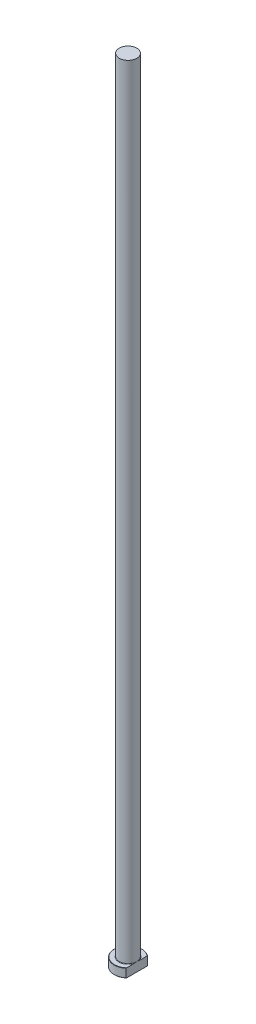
ISO-10303-21;
HEADER;
FILE_DESCRIPTION(('STEP AP214'),'2;1');
FILE_NAME('part.step','',(''),(''),'','','');
FILE_SCHEMA(('AUTOMOTIVE_DESIGN { 1 0 10303 214 1 1 1 1 }'));
ENDSEC;
DATA;
#1=APPLICATION_CONTEXT('core data for automotive mechanical design processes');
#2=APPLICATION_PROTOCOL_DEFINITION('international standard','automotive_design',2000,#1);
#3=PRODUCT_CONTEXT('',#1,'mechanical');
#4=PRODUCT('Part','Part','',(#3));
#5=PRODUCT_RELATED_PRODUCT_CATEGORY('part','',(#4));
#6=PRODUCT_DEFINITION_FORMATION('','',#4);
#7=PRODUCT_DEFINITION_CONTEXT('part definition',#1,'design');
#8=PRODUCT_DEFINITION('design','',#6,#7);
#9=PRODUCT_DEFINITION_SHAPE('','',#8);
#10=(LENGTH_UNIT() NAMED_UNIT(*) SI_UNIT(.MILLI.,.METRE.));
#11=(NAMED_UNIT(*) PLANE_ANGLE_UNIT() SI_UNIT($,.RADIAN.));
#12=(NAMED_UNIT(*) SI_UNIT($,.STERADIAN.) SOLID_ANGLE_UNIT());
#13=UNCERTAINTY_MEASURE_WITH_UNIT(LENGTH_MEASURE(1.E-05),#10,'distance_accuracy_value','');
#14=(GEOMETRIC_REPRESENTATION_CONTEXT(3) GLOBAL_UNCERTAINTY_ASSIGNED_CONTEXT((#13)) GLOBAL_UNIT_ASSIGNED_CONTEXT((#10,
#11,#12)) REPRESENTATION_CONTEXT('',''));
#15=CARTESIAN_POINT('',(0.,0.,0.));
#16=DIRECTION('',(0.,0.,1.));
#17=DIRECTION('',(1.,0.,0.));
#18=AXIS2_PLACEMENT_3D('',#15,#16,#17);
#19=CARTESIAN_POINT('',(0.,0.,0.));
#20=DIRECTION('',(0.,-1.,0.));
#21=DIRECTION('',(0.,0.,-1.));
#22=AXIS2_PLACEMENT_3D('',#19,#20,#21);
#23=PLANE('',#22);
#24=CARTESIAN_POINT('',(0.,0.,0.));
#25=DIRECTION('',(0.,-1.,0.));
#26=DIRECTION('',(0.,0.,-1.));
#27=AXIS2_PLACEMENT_3D('',#24,#25,#26);
#28=CIRCLE('',#27,10.8);
#29=CARTESIAN_POINT('',(6.99999999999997,0.,8.22435407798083));
#30=VERTEX_POINT('',#29);
#31=CARTESIAN_POINT('',(6.99999999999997,0.,-8.22435407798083));
#32=VERTEX_POINT('',#31);
#33=EDGE_CURVE('E98',#30,#32,#28,.T.);
#34=ORIENTED_EDGE('',*,*,#33,.T.);
#35=DIRECTION('',(0.,0.,1.));
#36=VECTOR('',#35,1.);
#37=CARTESIAN_POINT('',(6.99999999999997,0.,-8.48528137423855));
#38=LINE('',#37,#36);
#39=EDGE_CURVE('E83',#32,#30,#38,.T.);
#40=ORIENTED_EDGE('',*,*,#39,.T.);
#41=EDGE_LOOP('',(#34,#40));
#42=FACE_BOUND('',#41,.T.);
#43=ADVANCED_FACE('F32',(#42),#23,.T.);
#44=CARTESIAN_POINT('',(0.,259.958771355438,0.));
#45=DIRECTION('',(0.,1.,0.));
#46=DIRECTION('',(0.,0.,1.));
#47=AXIS2_PLACEMENT_3D('',#44,#45,#46);
#48=CYLINDRICAL_SURFACE('',#47,11.);
#49=CARTESIAN_POINT('',(0.,6.80000000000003,0.));
#50=DIRECTION('',(0.,1.,0.));
#51=DIRECTION('',(0.,0.,1.));
#52=AXIS2_PLACEMENT_3D('',#49,#50,#51);
#53=CIRCLE('',#52,11.);
#54=CARTESIAN_POINT('',(6.99999999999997,6.80000000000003,8.48528137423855));
#55=VERTEX_POINT('',#54);
#56=CARTESIAN_POINT('',(6.99999999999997,6.80000000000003,-8.48528137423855));
#57=VERTEX_POINT('',#56);
#58=EDGE_CURVE('E104',#55,#57,#53,.F.);
#59=ORIENTED_EDGE('',*,*,#58,.T.);
#60=DIRECTION('',(0.,-1.,0.));
#61=VECTOR('',#60,1.);
#62=CARTESIAN_POINT('',(6.99999999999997,630.,-8.48528137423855));
#63=LINE('',#62,#61);
#64=CARTESIAN_POINT('',(6.99999999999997,0.200000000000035,-8.48528137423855));
#65=VERTEX_POINT('',#64);
#66=EDGE_CURVE('E183',#57,#65,#63,.T.);
#67=ORIENTED_EDGE('',*,*,#66,.T.);
#68=CARTESIAN_POINT('',(0.,0.200000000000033,0.));
#69=DIRECTION('',(0.,-1.,0.));
#70=DIRECTION('',(0.,0.,-1.));
#71=AXIS2_PLACEMENT_3D('',#68,#69,#70);
#72=CIRCLE('',#71,11.);
#73=CARTESIAN_POINT('',(6.99999999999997,0.200000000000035,8.48528137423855));
#74=VERTEX_POINT('',#73);
#75=EDGE_CURVE('E100',#65,#74,#72,.F.);
#76=ORIENTED_EDGE('',*,*,#75,.T.);
#77=DIRECTION('',(0.,-1.,0.));
#78=VECTOR('',#77,1.);
#79=CARTESIAN_POINT('',(6.99999999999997,630.,8.48528137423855));
#80=LINE('',#79,#78);
#81=EDGE_CURVE('E93',#55,#74,#80,.T.);
#82=ORIENTED_EDGE('',*,*,#81,.F.);
#83=EDGE_LOOP('',(#59,#67,#76,#82));
#84=FACE_BOUND('',#83,.T.);
#85=ADVANCED_FACE('F158',(#84),#48,.T.);
#86=CARTESIAN_POINT('',(-11.,7.,0.));
#87=DIRECTION('',(0.,1.,0.));
#88=DIRECTION('',(0.,0.,1.));
#89=AXIS2_PLACEMENT_3D('',#86,#87,#88);
#90=PLANE('',#89);
#91=CARTESIAN_POINT('',(0.,7.,0.));
#92=DIRECTION('',(0.,1.,0.));
#93=DIRECTION('',(0.,0.,1.));
#94=AXIS2_PLACEMENT_3D('',#91,#92,#93);
#95=CIRCLE('',#94,10.8);
#96=CARTESIAN_POINT('',(6.99999999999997,7.,-8.22435407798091));
#97=VERTEX_POINT('',#96);
#98=CARTESIAN_POINT('',(6.99999999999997,7.,8.22435407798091));
#99=VERTEX_POINT('',#98);
#100=EDGE_CURVE('E178',#97,#99,#95,.T.);
#101=ORIENTED_EDGE('',*,*,#100,.T.);
#102=DIRECTION('',(0.,0.,-1.));
#103=VECTOR('',#102,1.);
#104=CARTESIAN_POINT('',(6.99999999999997,7.,0.));
#105=LINE('',#104,#103);
#106=CARTESIAN_POINT('',(6.99999999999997,6.99999999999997,2.07123151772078));
#107=VERTEX_POINT('',#106);
#108=EDGE_CURVE('E57',#99,#107,#105,.T.);
#109=ORIENTED_EDGE('',*,*,#108,.T.);
#110=CARTESIAN_POINT('',(0.,7.,0.));
#111=DIRECTION('',(0.,1.,0.));
#112=DIRECTION('',(0.,0.,1.));
#113=AXIS2_PLACEMENT_3D('',#110,#111,#112);
#114=CIRCLE('',#113,7.29999999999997);
#115=CARTESIAN_POINT('',(6.99999999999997,6.99999999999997,-2.07123151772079));
#116=VERTEX_POINT('',#115);
#117=EDGE_CURVE('E107',#107,#116,#114,.F.);
#118=ORIENTED_EDGE('',*,*,#117,.T.);
#119=EDGE_CURVE('E136',#116,#97,#105,.T.);
#120=ORIENTED_EDGE('',*,*,#119,.T.);
#121=EDGE_LOOP('',(#101,#109,#118,#120));
#122=FACE_BOUND('',#121,.T.);
#123=ADVANCED_FACE('F147',(#122),#90,.T.);
#124=CARTESIAN_POINT('',(0.,7.00000000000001,0.));
#125=DIRECTION('',(0.,-1.,0.));
#126=DIRECTION('',(0.,0.,-1.));
#127=AXIS2_PLACEMENT_3D('',#124,#125,#126);
#128=CONICAL_SURFACE('',#127,10.8,0.785398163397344);
#129=ORIENTED_EDGE('',*,*,#58,.F.);
#130=CARTESIAN_POINT('',(6.99999999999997,-2.1377497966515,18.6685261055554));
#131=CARTESIAN_POINT('',(6.99999999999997,-1.86574872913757,18.3780244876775));
#132=CARTESIAN_POINT('',(6.99999999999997,-1.59415659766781,18.0871392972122));
#133=CARTESIAN_POINT('',(6.99999999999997,-1.05192877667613,17.5044755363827));
#134=CARTESIAN_POINT('',(6.99999999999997,-0.781293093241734,17.2126969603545));
#135=CARTESIAN_POINT('',(6.99999999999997,-0.241050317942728,16.6280482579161));
#136=CARTESIAN_POINT('',(6.99999999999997,0.0285564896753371,16.3351778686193));
#137=CARTESIAN_POINT('',(6.99999999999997,0.566485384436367,15.7482616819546));
#138=CARTESIAN_POINT('',(6.99999999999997,0.834807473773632,15.454215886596));
#139=CARTESIAN_POINT('',(6.99999999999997,1.64198377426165,14.5651645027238));
#140=CARTESIAN_POINT('',(6.99999999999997,2.17856420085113,13.9680841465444));
#141=CARTESIAN_POINT('',(6.99999999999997,2.97696333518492,13.0668144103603));
#142=CARTESIAN_POINT('',(6.99999999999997,3.2419978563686,12.7654727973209));
#143=CARTESIAN_POINT('',(6.99999999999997,3.76945856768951,12.1605141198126));
#144=CARTESIAN_POINT('',(6.99999999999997,4.03188476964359,11.8568970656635));
#145=CARTESIAN_POINT('',(6.99999999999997,4.50733797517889,11.3009625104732));
#146=CARTESIAN_POINT('',(6.99999999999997,4.72088020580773,11.0490858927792));
#147=CARTESIAN_POINT('',(6.99999999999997,5.14538078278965,10.5431655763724));
#148=CARTESIAN_POINT('',(6.99999999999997,5.35633915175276,10.2891218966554));
#149=CARTESIAN_POINT('',(6.99999999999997,5.77522964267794,9.77836737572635));
#150=CARTESIAN_POINT('',(6.99999999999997,5.98316044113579,9.52165544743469));
#151=CARTESIAN_POINT('',(6.99999999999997,6.39521098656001,9.0051908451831));
#152=CARTESIAN_POINT('',(6.99999999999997,6.5993307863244,8.74543821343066));
#153=CARTESIAN_POINT('',(6.99999999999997,7.0024344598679,8.22283607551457));
#154=CARTESIAN_POINT('',(6.99999999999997,7.20142819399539,7.95999419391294));
#155=CARTESIAN_POINT('',(6.99999999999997,7.59353840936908,7.42991856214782));
#156=CARTESIAN_POINT('',(6.99999999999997,7.7866544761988,7.16268450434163));
#157=CARTESIAN_POINT('',(6.99999999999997,8.16523718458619,6.62311113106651));
#158=CARTESIAN_POINT('',(6.99999999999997,8.35070911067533,6.35077553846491));
#159=CARTESIAN_POINT('',(6.99999999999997,8.71189725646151,5.79973731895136));
#160=CARTESIAN_POINT('',(6.99999999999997,8.8876153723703,5.52103594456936));
#161=CARTESIAN_POINT('',(6.99999999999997,9.19554959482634,5.00707921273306));
#162=CARTESIAN_POINT('',(6.99999999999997,9.32988075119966,4.77309669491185));
#163=CARTESIAN_POINT('',(6.99999999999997,9.58764253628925,4.29911523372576));
#164=CARTESIAN_POINT('',(6.99999999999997,9.71107181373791,4.05911554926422));
#165=CARTESIAN_POINT('',(6.99999999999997,9.94390907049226,3.57263619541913));
#166=CARTESIAN_POINT('',(6.99999999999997,10.0533307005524,3.32616312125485));
#167=CARTESIAN_POINT('',(6.99999999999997,10.2545146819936,2.82607166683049));
#168=CARTESIAN_POINT('',(6.99999999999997,10.3462820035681,2.57245532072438));
#169=CARTESIAN_POINT('',(6.99999999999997,10.4907049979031,2.1125444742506));
#170=CARTESIAN_POINT('',(6.99999999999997,10.5475277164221,1.90756611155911));
#171=CARTESIAN_POINT('',(6.99999999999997,10.6452043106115,1.4938116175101));
#172=CARTESIAN_POINT('',(6.99999999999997,10.68606033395,1.2850360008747));
#173=CARTESIAN_POINT('',(6.99999999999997,10.7497550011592,0.865342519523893));
#174=CARTESIAN_POINT('',(6.99999999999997,10.7726462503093,0.654432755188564));
#175=CARTESIAN_POINT('',(6.99999999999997,10.7993569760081,0.23139650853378));
#176=CARTESIAN_POINT('',(6.99999999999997,10.8031771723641,0.0192700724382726));
#177=CARTESIAN_POINT('',(6.99999999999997,10.791517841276,-0.404715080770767));
#178=CARTESIAN_POINT('',(6.99999999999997,10.7760135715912,-0.616573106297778));
#179=CARTESIAN_POINT('',(6.99999999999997,10.7265413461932,-1.03810446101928));
#180=CARTESIAN_POINT('',(6.99999999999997,10.6925718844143,-1.24777761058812));
#181=CARTESIAN_POINT('',(6.99999999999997,10.6077703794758,-1.66430273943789));
#182=CARTESIAN_POINT('',(6.99999999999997,10.5568873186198,-1.87114418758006));
#183=CARTESIAN_POINT('',(6.99999999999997,10.4404729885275,-2.2806127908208));
#184=CARTESIAN_POINT('',(6.99999999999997,10.3749414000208,-2.48323985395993));
#185=CARTESIAN_POINT('',(6.99999999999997,10.2190980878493,-2.91860265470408));
#186=CARTESIAN_POINT('',(6.99999999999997,10.1264616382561,-3.1505003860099));
#187=CARTESIAN_POINT('',(6.99999999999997,9.92740958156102,-3.6083545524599));
#188=CARTESIAN_POINT('',(6.99999999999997,9.82098769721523,-3.83430822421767));
#189=CARTESIAN_POINT('',(6.99999999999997,9.59695142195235,-4.28105341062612));
#190=CARTESIAN_POINT('',(6.99999999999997,9.47931762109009,-4.50183511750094));
#191=CARTESIAN_POINT('',(6.99999999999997,9.23524231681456,-4.93840249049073));
#192=CARTESIAN_POINT('',(6.99999999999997,9.1088020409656,-5.15418884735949));
#193=CARTESIAN_POINT('',(6.99999999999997,8.84714657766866,-5.58417945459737));
#194=CARTESIAN_POINT('',(6.99999999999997,8.7118392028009,-5.79832734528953));
#195=CARTESIAN_POINT('',(6.99999999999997,8.43533082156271,-6.22277635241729));
#196=CARTESIAN_POINT('',(6.99999999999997,8.29412966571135,-6.43307737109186));
#197=CARTESIAN_POINT('',(6.99999999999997,8.00706556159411,-6.85014007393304));
#198=CARTESIAN_POINT('',(6.99999999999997,7.86120763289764,-7.0569052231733));
#199=CARTESIAN_POINT('',(6.99999999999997,7.56553131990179,-7.4675727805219));
#200=CARTESIAN_POINT('',(6.99999999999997,7.41571298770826,-7.67147522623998));
#201=CARTESIAN_POINT('',(6.99999999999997,7.07999705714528,-8.12067189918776));
#202=CARTESIAN_POINT('',(6.99999999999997,6.89330819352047,-8.36537403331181));
#203=CARTESIAN_POINT('',(6.99999999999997,6.51597189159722,-8.85171196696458));
#204=CARTESIAN_POINT('',(6.99999999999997,6.32532432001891,-9.09334766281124));
#205=CARTESIAN_POINT('',(6.99999999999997,5.94076020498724,-9.57404667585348));
#206=CARTESIAN_POINT('',(6.99999999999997,5.74684327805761,-9.81310968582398));
#207=CARTESIAN_POINT('',(6.99999999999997,5.35630729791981,-10.2890203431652));
#208=CARTESIAN_POINT('',(6.99999999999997,5.1596882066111,-10.5258679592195));
#209=CARTESIAN_POINT('',(6.99999999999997,4.56606953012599,-11.2340330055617));
#210=CARTESIAN_POINT('',(6.99999999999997,4.1656814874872,-11.7025100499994));
#211=CARTESIAN_POINT('',(6.99999999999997,3.35840033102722,-12.6338245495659));
#212=CARTESIAN_POINT('',(6.99999999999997,2.9515070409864,-13.0966618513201));
#213=CARTESIAN_POINT('',(6.99999999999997,2.35017562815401,-13.7734103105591));
#214=CARTESIAN_POINT('',(6.99999999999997,2.1576381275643,-13.9890143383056));
#215=CARTESIAN_POINT('',(6.99999999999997,1.77161609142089,-14.4193671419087));
#216=CARTESIAN_POINT('',(6.99999999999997,1.57813157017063,-14.6341159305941));
#217=CARTESIAN_POINT('',(6.99999999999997,0.996412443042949,-15.2772388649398));
#218=CARTESIAN_POINT('',(6.99999999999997,0.606922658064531,-15.7044779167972));
#219=CARTESIAN_POINT('',(6.99999999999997,-0.173895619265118,-16.555652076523));
#220=CARTESIAN_POINT('',(6.99999999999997,-0.565218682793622,-16.9795921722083));
#221=CARTESIAN_POINT('',(6.99999999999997,-1.3499993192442,-17.8254589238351));
#222=CARTESIAN_POINT('',(6.99999999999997,-1.74345679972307,-18.2473856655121));
#223=CARTESIAN_POINT('',(6.99999999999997,-2.1377497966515,-18.6685261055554));
#224=B_SPLINE_CURVE_WITH_KNOTS('',3,(#130,#131,#132,#133,#134,#135,#136,#137,#138,#139,#140,
#141,#142,#143,#144,#145,#146,#147,#148,#149,#150,#151,#152,#153,#154,#155,#156,#157,#158,#159,
#160,#161,#162,#163,#164,#165,#166,#167,#168,#169,#170,#171,#172,#173,#174,#175,#176,#177,#178,
#179,#180,#181,#182,#183,#184,#185,#186,#187,#188,#189,#190,#191,#192,#193,#194,#195,#196,#197,
#198,#199,#200,#201,#202,#203,#204,#205,#206,#207,#208,#209,#210,#211,#212,#213,#214,#215,#216,
#217,#218,#219,#220,#221,#222,#223),.UNSPECIFIED.,.F.,.F.,(4,2,2,2,2,2,2,2,2,2,2,2,2,2,2,2,2,2,
2,2,2,2,2,2,2,2,2,2,2,2,2,2,2,2,2,2,2,2,2,2,2,2,2,2,2,2,4),(0.,1.19389386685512,
2.38779531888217,3.58200567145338,4.77621398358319,7.1844215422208,8.38834194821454,
9.59225689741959,10.5828886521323,11.5735117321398,12.5645555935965,13.5555857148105,
14.544540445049,15.5335647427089,16.5218934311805,17.5100293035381,18.319208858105,
19.1284885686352,19.9369735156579,20.7452305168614,21.382812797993,22.0203092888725,
22.6559319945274,23.2915307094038,23.927944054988,24.564409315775,25.2028120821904,
25.8412287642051,26.5898097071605,27.3387327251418,28.0889766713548,28.8391162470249,
29.5989369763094,30.3587769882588,31.1178239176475,31.87686086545,32.8001653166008,
33.7235009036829,34.6469455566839,35.5704032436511,37.4191008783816,39.2678486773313,
40.1350269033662,41.0021920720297,42.736569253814,44.4673795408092,46.1981154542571),.UNSPECIFIED.);
#225=EDGE_CURVE('E135',#55,#99,#224,.T.);
#226=ORIENTED_EDGE('',*,*,#225,.T.);
#227=ORIENTED_EDGE('',*,*,#100,.F.);
#228=EDGE_CURVE('E127',#97,#57,#224,.T.);
#229=ORIENTED_EDGE('',*,*,#228,.T.);
#230=EDGE_LOOP('',(#129,#226,#227,#229));
#231=FACE_BOUND('',#230,.T.);
#232=ADVANCED_FACE('F143',(#231),#128,.T.);
#233=CARTESIAN_POINT('',(0.,0.200000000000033,0.));
#234=DIRECTION('',(0.,1.,0.));
#235=DIRECTION('',(0.,0.,1.));
#236=AXIS2_PLACEMENT_3D('',#233,#234,#235);
#237=CONICAL_SURFACE('',#236,11.,0.785398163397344);
#238=ORIENTED_EDGE('',*,*,#75,.F.);
#239=CARTESIAN_POINT('',(6.99999999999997,9.13774979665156,-18.6685261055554));
#240=CARTESIAN_POINT('',(6.99999999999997,8.86574872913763,-18.3780244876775));
#241=CARTESIAN_POINT('',(6.99999999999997,8.59415659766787,-18.0871392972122));
#242=CARTESIAN_POINT('',(6.99999999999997,8.05192877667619,-17.5044755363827));
#243=CARTESIAN_POINT('',(6.99999999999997,7.7812930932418,-17.2126969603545));
#244=CARTESIAN_POINT('',(6.99999999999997,7.24105031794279,-16.6280482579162));
#245=CARTESIAN_POINT('',(6.99999999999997,6.97144351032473,-16.3351778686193));
#246=CARTESIAN_POINT('',(6.99999999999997,6.4335146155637,-15.7482616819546));
#247=CARTESIAN_POINT('',(6.99999999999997,6.16519252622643,-15.454215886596));
#248=CARTESIAN_POINT('',(6.99999999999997,5.35801622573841,-14.5651645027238));
#249=CARTESIAN_POINT('',(6.99999999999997,4.82143579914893,-13.9680841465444));
#250=CARTESIAN_POINT('',(6.99999999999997,4.02303666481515,-13.0668144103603));
#251=CARTESIAN_POINT('',(6.99999999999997,3.75800214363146,-12.7654727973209));
#252=CARTESIAN_POINT('',(6.99999999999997,3.23054143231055,-12.1605141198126));
#253=CARTESIAN_POINT('',(6.99999999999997,2.96811523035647,-11.8568970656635));
#254=CARTESIAN_POINT('',(6.99999999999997,2.49266202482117,-11.3009625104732));
#255=CARTESIAN_POINT('',(6.99999999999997,2.27911979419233,-11.0490858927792));
#256=CARTESIAN_POINT('',(6.99999999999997,1.85461921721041,-10.5431655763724));
#257=CARTESIAN_POINT('',(6.99999999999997,1.6436608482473,-10.2891218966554));
#258=CARTESIAN_POINT('',(6.99999999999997,1.22477035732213,-9.77836737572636));
#259=CARTESIAN_POINT('',(6.99999999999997,1.01683955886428,-9.5216554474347));
#260=CARTESIAN_POINT('',(6.99999999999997,0.60478901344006,-9.0051908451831));
#261=CARTESIAN_POINT('',(6.99999999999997,0.400669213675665,-8.74543821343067));
#262=CARTESIAN_POINT('',(6.99999999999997,-0.00243445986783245,-8.22283607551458));
#263=CARTESIAN_POINT('',(6.99999999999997,-0.201428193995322,-7.95999419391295));
#264=CARTESIAN_POINT('',(6.99999999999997,-0.59353840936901,-7.42991856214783));
#265=CARTESIAN_POINT('',(6.99999999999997,-0.786654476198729,-7.16268450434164));
#266=CARTESIAN_POINT('',(6.99999999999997,-1.16523718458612,-6.62311113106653));
#267=CARTESIAN_POINT('',(6.99999999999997,-1.35070911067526,-6.35077553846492));
#268=CARTESIAN_POINT('',(6.99999999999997,-1.71189725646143,-5.79973731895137));
#269=CARTESIAN_POINT('',(6.99999999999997,-1.88761537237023,-5.52103594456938));
#270=CARTESIAN_POINT('',(6.99999999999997,-2.19554959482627,-5.00707921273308));
#271=CARTESIAN_POINT('',(6.99999999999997,-2.32988075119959,-4.77309669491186));
#272=CARTESIAN_POINT('',(6.99999999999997,-2.58764253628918,-4.29911523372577));
#273=CARTESIAN_POINT('',(6.99999999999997,-2.71107181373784,-4.05911554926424));
#274=CARTESIAN_POINT('',(6.99999999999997,-2.94390907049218,-3.57263619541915));
#275=CARTESIAN_POINT('',(6.99999999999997,-3.05333070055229,-3.32616312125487));
#276=CARTESIAN_POINT('',(6.99999999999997,-3.25451468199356,-2.82607166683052));
#277=CARTESIAN_POINT('',(6.99999999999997,-3.34628200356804,-2.5724553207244));
#278=CARTESIAN_POINT('',(6.99999999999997,-3.49070499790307,-2.11254447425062));
#279=CARTESIAN_POINT('',(6.99999999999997,-3.54752771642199,-1.90756611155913));
#280=CARTESIAN_POINT('',(6.99999999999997,-3.6452043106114,-1.49381161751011));
#281=CARTESIAN_POINT('',(6.99999999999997,-3.68606033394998,-1.28503600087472));
#282=CARTESIAN_POINT('',(6.99999999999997,-3.74975500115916,-0.865342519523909));
#283=CARTESIAN_POINT('',(6.99999999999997,-3.77264625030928,-0.65443275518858));
#284=CARTESIAN_POINT('',(6.99999999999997,-3.79935697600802,-0.231396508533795));
#285=CARTESIAN_POINT('',(6.99999999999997,-3.80317717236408,-0.0192700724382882));
#286=CARTESIAN_POINT('',(6.99999999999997,-3.79151784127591,0.40471508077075));
#287=CARTESIAN_POINT('',(6.99999999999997,-3.77601357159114,0.61657310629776));
#288=CARTESIAN_POINT('',(6.99999999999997,-3.72654134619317,1.03810446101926));
#289=CARTESIAN_POINT('',(6.99999999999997,-3.69257188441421,1.2477776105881));
#290=CARTESIAN_POINT('',(6.99999999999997,-3.6077703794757,1.66430273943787));
#291=CARTESIAN_POINT('',(6.99999999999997,-3.55688731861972,1.87114418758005));
#292=CARTESIAN_POINT('',(6.99999999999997,-3.44047298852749,2.28061279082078));
#293=CARTESIAN_POINT('',(6.99999999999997,-3.37494140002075,2.48323985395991));
#294=CARTESIAN_POINT('',(6.99999999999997,-3.21909808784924,2.91860265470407));
#295=CARTESIAN_POINT('',(6.99999999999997,-3.12646163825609,3.15050038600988));
#296=CARTESIAN_POINT('',(6.99999999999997,-2.92740958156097,3.60835455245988));
#297=CARTESIAN_POINT('',(6.99999999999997,-2.82098769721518,3.83430822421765));
#298=CARTESIAN_POINT('',(6.99999999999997,-2.5969514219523,4.2810534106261));
#299=CARTESIAN_POINT('',(6.99999999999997,-2.47931762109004,4.50183511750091));
#300=CARTESIAN_POINT('',(6.99999999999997,-2.23524231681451,4.93840249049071));
#301=CARTESIAN_POINT('',(6.99999999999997,-2.10880204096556,5.15418884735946));
#302=CARTESIAN_POINT('',(6.99999999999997,-1.84714657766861,5.58417945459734));
#303=CARTESIAN_POINT('',(6.99999999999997,-1.71183920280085,5.7983273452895));
#304=CARTESIAN_POINT('',(6.99999999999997,-1.43533082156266,6.22277635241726));
#305=CARTESIAN_POINT('',(6.99999999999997,-1.29412966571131,6.43307737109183));
#306=CARTESIAN_POINT('',(6.99999999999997,-1.00706556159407,6.85014007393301));
#307=CARTESIAN_POINT('',(6.99999999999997,-0.861207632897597,7.05690522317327));
#308=CARTESIAN_POINT('',(6.99999999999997,-0.565531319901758,7.46757278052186));
#309=CARTESIAN_POINT('',(6.99999999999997,-0.415712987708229,7.67147522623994));
#310=CARTESIAN_POINT('',(6.99999999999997,-0.0799970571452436,8.12067189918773));
#311=CARTESIAN_POINT('',(6.99999999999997,0.106691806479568,8.36537403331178));
#312=CARTESIAN_POINT('',(6.99999999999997,0.484028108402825,8.85171196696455));
#313=CARTESIAN_POINT('',(6.99999999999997,0.674675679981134,9.09334766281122));
#314=CARTESIAN_POINT('',(6.99999999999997,1.0592397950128,9.57404667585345));
#315=CARTESIAN_POINT('',(6.99999999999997,1.25315672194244,9.81310968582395));
#316=CARTESIAN_POINT('',(6.99999999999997,1.64369270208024,10.2890203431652));
#317=CARTESIAN_POINT('',(6.99999999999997,1.84031179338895,10.5258679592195));
#318=CARTESIAN_POINT('',(6.99999999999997,2.43393046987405,11.2340330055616));
#319=CARTESIAN_POINT('',(6.99999999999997,2.83431851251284,11.7025100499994));
#320=CARTESIAN_POINT('',(6.99999999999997,3.64159966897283,12.6338245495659));
#321=CARTESIAN_POINT('',(6.99999999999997,4.04849295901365,13.0966618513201));
#322=CARTESIAN_POINT('',(6.99999999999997,4.64982437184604,13.773410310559));
#323=CARTESIAN_POINT('',(6.99999999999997,4.84236187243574,13.9890143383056));
#324=CARTESIAN_POINT('',(6.99999999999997,5.22838390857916,14.4193671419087));
#325=CARTESIAN_POINT('',(6.99999999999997,5.42186842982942,14.6341159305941));
#326=CARTESIAN_POINT('',(6.99999999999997,6.0035875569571,15.2772388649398));
#327=CARTESIAN_POINT('',(6.99999999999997,6.39307734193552,15.7044779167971));
#328=CARTESIAN_POINT('',(6.99999999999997,7.17389561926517,16.555652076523));
#329=CARTESIAN_POINT('',(6.99999999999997,7.56521868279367,16.9795921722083));
#330=CARTESIAN_POINT('',(6.99999999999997,8.34999931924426,17.8254589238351));
#331=CARTESIAN_POINT('',(6.99999999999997,8.74345679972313,18.2473856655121));
#332=CARTESIAN_POINT('',(6.99999999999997,9.13774979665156,18.6685261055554));
#333=B_SPLINE_CURVE_WITH_KNOTS('',3,(#239,#240,#241,#242,#243,#244,#245,#246,#247,#248,#249,
#250,#251,#252,#253,#254,#255,#256,#257,#258,#259,#260,#261,#262,#263,#264,#265,#266,#267,#268,
#269,#270,#271,#272,#273,#274,#275,#276,#277,#278,#279,#280,#281,#282,#283,#284,#285,#286,#287,
#288,#289,#290,#291,#292,#293,#294,#295,#296,#297,#298,#299,#300,#301,#302,#303,#304,#305,#306,
#307,#308,#309,#310,#311,#312,#313,#314,#315,#316,#317,#318,#319,#320,#321,#322,#323,#324,#325,
#326,#327,#328,#329,#330,#331,#332),.UNSPECIFIED.,.F.,.F.,(4,2,2,2,2,2,2,2,2,2,2,2,2,2,2,2,2,2,
2,2,2,2,2,2,2,2,2,2,2,2,2,2,2,2,2,2,2,2,2,2,2,2,2,2,2,2,4),(0.,1.19389386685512,
2.38779531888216,3.58200567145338,4.77621398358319,7.18442154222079,8.38834194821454,
9.59225689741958,10.5828886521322,11.5735117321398,12.5645555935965,13.5555857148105,
14.544540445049,15.5335647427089,16.5218934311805,17.5100293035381,18.319208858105,
19.1284885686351,19.9369735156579,20.7452305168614,21.382812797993,22.0203092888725,
22.6559319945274,23.2915307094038,23.927944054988,24.564409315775,25.2028120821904,
25.8412287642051,26.5898097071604,27.3387327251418,28.0889766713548,28.8391162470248,
29.5989369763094,30.3587769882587,31.1178239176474,31.8768608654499,32.8001653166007,
33.7235009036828,34.6469455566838,35.5704032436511,37.4191008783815,39.2678486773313,
40.1350269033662,41.0021920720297,42.736569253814,44.4673795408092,46.1981154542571),.UNSPECIFIED.);
#334=EDGE_CURVE('E86',#65,#32,#333,.T.);
#335=ORIENTED_EDGE('',*,*,#334,.T.);
#336=ORIENTED_EDGE('',*,*,#33,.F.);
#337=EDGE_CURVE('E89',#30,#74,#333,.T.);
#338=ORIENTED_EDGE('',*,*,#337,.T.);
#339=EDGE_LOOP('',(#238,#335,#336,#338));
#340=FACE_BOUND('',#339,.T.);
#341=ADVANCED_FACE('F97',(#340),#237,.T.);
#342=CARTESIAN_POINT('',(0.,7.29999999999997,0.));
#343=DIRECTION('',(0.,1.,0.));
#344=DIRECTION('',(0.,0.,1.));
#345=AXIS2_PLACEMENT_3D('',#342,#343,#344);
#346=TOROIDAL_SURFACE('',#345,7.29999999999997,0.3);
#347=CARTESIAN_POINT('',(6.99999999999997,7.29999999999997,0.));
#348=CARTESIAN_POINT('',(6.99999999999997,7.30000062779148,2.32628005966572E-11));
#349=CARTESIAN_POINT('',(6.99999999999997,7.30000125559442,-3.16909134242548E-07));
#350=CARTESIAN_POINT('',(6.99999999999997,7.30000241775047,-1.14637029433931E-06));
#351=CARTESIAN_POINT('',(6.99999999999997,7.30000292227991,-1.68168827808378E-06));
#352=CARTESIAN_POINT('',(6.99999999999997,7.30000400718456,-2.97869768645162E-06));
#353=CARTESIAN_POINT('',(6.99999999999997,7.30000456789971,-3.76131367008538E-06));
#354=CARTESIAN_POINT('',(6.99999999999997,7.30000553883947,-5.35167977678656E-06));
#355=CARTESIAN_POINT('',(6.99999999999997,7.30000595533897,-6.15604635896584E-06));
#356=CARTESIAN_POINT('',(6.99999999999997,7.30000758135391,-9.388029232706E-06));
#357=CARTESIAN_POINT('',(6.99999999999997,7.30000871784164,-1.18573464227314E-05));
#358=CARTESIAN_POINT('',(6.99999999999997,7.30001050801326,-1.66549715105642E-05));
#359=CARTESIAN_POINT('',(6.99999999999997,7.30001120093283,-1.89691200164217E-05));
#360=CARTESIAN_POINT('',(6.99999999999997,7.30001423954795,-2.9073526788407E-05));
#361=CARTESIAN_POINT('',(6.99999999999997,7.30001661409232,-3.68567169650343E-05));
#362=CARTESIAN_POINT('',(6.99999999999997,7.30001997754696,-5.13387672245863E-05));
#363=CARTESIAN_POINT('',(6.99999999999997,7.30002113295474,-5.79981986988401E-05));
#364=CARTESIAN_POINT('',(6.99999999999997,7.30002974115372,-0.000108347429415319));
#365=CARTESIAN_POINT('',(6.99999999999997,7.30003649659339,-0.000152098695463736));
#366=CARTESIAN_POINT('',(6.99999999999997,7.30006604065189,-0.000326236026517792));
#367=CARTESIAN_POINT('',(6.99999999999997,7.30009398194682,-0.000455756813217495));
#368=CARTESIAN_POINT('',(6.99999999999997,7.30020370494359,-0.000971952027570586));
#369=CARTESIAN_POINT('',(6.99999999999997,7.30028233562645,-0.00135905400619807));
#370=CARTESIAN_POINT('',(6.99999999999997,7.30059908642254,-0.00290811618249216));
#371=CARTESIAN_POINT('',(6.99999999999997,7.30084128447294,-0.00406949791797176));
#372=CARTESIAN_POINT('',(6.99999999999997,7.30185637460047,-0.00894870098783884));
#373=CARTESIAN_POINT('',(6.99999999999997,7.30262406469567,-0.0126672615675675));
#374=CARTESIAN_POINT('',(6.99999999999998,7.30904362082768,-0.0437472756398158));
#375=CARTESIAN_POINT('',(6.99999999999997,7.31471492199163,-0.0711060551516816));
#376=CARTESIAN_POINT('',(6.99999999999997,7.3257989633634,-0.124711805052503));
#377=CARTESIAN_POINT('',(6.99999999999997,7.33121280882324,-0.150958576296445));
#378=CARTESIAN_POINT('',(6.99999999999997,7.34888721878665,-0.236855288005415));
#379=CARTESIAN_POINT('',(6.99999999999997,7.36109504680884,-0.296516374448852));
#380=CARTESIAN_POINT('',(6.99999999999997,7.38163193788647,-0.398125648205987));
#381=CARTESIAN_POINT('',(6.99999999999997,7.39003371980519,-0.440059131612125));
#382=CARTESIAN_POINT('',(6.99999999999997,7.40641913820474,-0.522820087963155));
#383=CARTESIAN_POINT('',(6.99999999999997,7.41440792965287,-0.563646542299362));
#384=CARTESIAN_POINT('',(6.99999999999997,7.44025584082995,-0.697745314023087));
#385=CARTESIAN_POINT('',(6.99999999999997,7.45763052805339,-0.791112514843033));
#386=CARTESIAN_POINT('',(6.99999999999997,7.4907040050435,-0.979068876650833));
#387=CARTESIAN_POINT('',(6.99999999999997,7.50638514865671,-1.07366117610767));
#388=CARTESIAN_POINT('',(6.99999999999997,7.53649600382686,-1.27237182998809));
#389=CARTESIAN_POINT('',(6.99999999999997,7.55066037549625,-1.37653153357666));
#390=CARTESIAN_POINT('',(6.99999999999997,7.57450660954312,-1.58508707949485));
#391=CARTESIAN_POINT('',(6.99999999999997,7.58420070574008,-1.68948148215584));
#392=CARTESIAN_POINT('',(6.99999999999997,7.5971656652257,-1.89515538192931));
#393=CARTESIAN_POINT('',(6.99999999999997,7.60064432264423,-1.9964196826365));
#394=CARTESIAN_POINT('',(6.99999999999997,7.59954163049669,-2.14745317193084));
#395=CARTESIAN_POINT('',(6.99999999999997,7.59815772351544,-2.19724153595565));
#396=CARTESIAN_POINT('',(6.99999999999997,7.59283451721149,-2.29666246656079));
#397=CARTESIAN_POINT('',(6.99999999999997,7.58889656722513,-2.34629510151));
#398=CARTESIAN_POINT('',(6.99999999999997,7.57769755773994,-2.44571674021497));
#399=CARTESIAN_POINT('',(6.99999999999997,7.57040396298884,-2.49550242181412));
#400=CARTESIAN_POINT('',(6.99999999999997,7.5560244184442,-2.56951537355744));
#401=CARTESIAN_POINT('',(6.99999999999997,7.55065780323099,-2.59407625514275));
#402=CARTESIAN_POINT('',(6.99999999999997,7.53852479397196,-2.642845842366));
#403=CARTESIAN_POINT('',(6.99999999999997,7.53175908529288,-2.66705471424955));
#404=CARTESIAN_POINT('',(6.99999999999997,7.5174892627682,-2.71174649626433));
#405=CARTESIAN_POINT('',(6.99999999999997,7.510201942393,-2.73229789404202));
#406=CARTESIAN_POINT('',(6.99999999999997,7.4939308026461,-2.77282387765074));
#407=CARTESIAN_POINT('',(6.99999999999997,7.4849410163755,-2.79279614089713));
#408=CARTESIAN_POINT('',(6.99999999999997,7.46462265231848,-2.83190553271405));
#409=CARTESIAN_POINT('',(6.99999999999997,7.45326134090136,-2.85102586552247));
#410=CARTESIAN_POINT('',(6.99999999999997,7.4274542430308,-2.88704231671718));
#411=CARTESIAN_POINT('',(6.99999999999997,7.41303489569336,-2.90395561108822));
#412=CARTESIAN_POINT('',(6.99999999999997,7.39049681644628,-2.92384155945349));
#413=CARTESIAN_POINT('',(6.99999999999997,7.3841904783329,-2.92884725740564));
#414=CARTESIAN_POINT('',(6.99999999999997,7.3709718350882,-2.9380049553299));
#415=CARTESIAN_POINT('',(6.99999999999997,7.36405938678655,-2.94215675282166));
#416=CARTESIAN_POINT('',(6.99999999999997,7.34956926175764,-2.94936604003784));
#417=CARTESIAN_POINT('',(6.99999999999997,7.34198467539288,-2.95240998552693));
#418=CARTESIAN_POINT('',(6.99999999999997,7.32637763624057,-2.95700924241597));
#419=CARTESIAN_POINT('',(6.99999999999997,7.31835605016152,-2.95856739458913));
#420=CARTESIAN_POINT('',(6.99999999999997,7.3029104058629,-2.95992508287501));
#421=CARTESIAN_POINT('',(6.99999999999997,7.29549953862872,-2.95987367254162));
#422=CARTESIAN_POINT('',(6.99999999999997,7.28081803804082,-2.95838504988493));
#423=CARTESIAN_POINT('',(6.99999999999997,7.27354749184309,-2.95694700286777));
#424=CARTESIAN_POINT('',(6.99999999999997,7.25853285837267,-2.95260391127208));
#425=CARTESIAN_POINT('',(6.99999999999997,7.25083383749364,-2.94954604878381));
#426=CARTESIAN_POINT('',(6.99999999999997,7.23603628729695,-2.9422241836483));
#427=CARTESIAN_POINT('',(6.99999999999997,7.22893877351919,-2.93795819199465));
#428=CARTESIAN_POINT('',(6.99999999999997,7.21163875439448,-2.92593351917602));
#429=CARTESIAN_POINT('',(6.99999999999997,7.20187862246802,-2.91754511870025));
#430=CARTESIAN_POINT('',(6.99999999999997,7.18370674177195,-2.89942475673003));
#431=CARTESIAN_POINT('',(6.99999999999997,7.17529892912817,-2.88968902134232));
#432=CARTESIAN_POINT('',(6.99999999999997,7.15199560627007,-2.85953893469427));
#433=CARTESIAN_POINT('',(6.99999999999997,7.13869481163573,-2.83790736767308));
#434=CARTESIAN_POINT('',(6.99999999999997,7.11507068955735,-2.79314645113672));
#435=CARTESIAN_POINT('',(6.99999999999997,7.10475206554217,-2.77001480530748));
#436=CARTESIAN_POINT('',(6.99999999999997,7.08155610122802,-2.7108784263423));
#437=CARTESIAN_POINT('',(6.99999999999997,7.07006528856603,-2.67433519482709));
#438=CARTESIAN_POINT('',(6.99999999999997,7.05044959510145,-2.60033159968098));
#439=CARTESIAN_POINT('',(6.99999999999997,7.04233234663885,-2.5628693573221));
#440=CARTESIAN_POINT('',(6.99999999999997,7.02853576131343,-2.48688638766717));
#441=CARTESIAN_POINT('',(6.99999999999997,7.02289758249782,-2.4483583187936));
#442=CARTESIAN_POINT('',(6.99999999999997,7.01369461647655,-2.37112071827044));
#443=CARTESIAN_POINT('',(6.99999999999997,7.01012698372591,-2.33241150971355));
#444=CARTESIAN_POINT('',(6.99999999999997,7.00239886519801,-2.22280038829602));
#445=CARTESIAN_POINT('',(6.99999999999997,7.00019016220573,-2.15176184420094));
#446=CARTESIAN_POINT('',(6.99999999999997,6.99983406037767,-2.0096618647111));
#447=CARTESIAN_POINT('',(6.99999999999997,7.00168936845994,-1.9386004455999));
#448=CARTESIAN_POINT('',(6.99999999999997,7.00854815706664,-1.79630907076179));
#449=CARTESIAN_POINT('',(6.99999999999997,7.01356610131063,-1.7250798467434));
#450=CARTESIAN_POINT('',(6.99999999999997,7.02608998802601,-1.5828366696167));
#451=CARTESIAN_POINT('',(6.99999999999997,7.03359634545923,-1.51182275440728));
#452=CARTESIAN_POINT('',(6.99999999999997,7.0575822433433,-1.31152735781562));
#453=CARTESIAN_POINT('',(6.99999999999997,7.07635481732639,-1.18252326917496));
#454=CARTESIAN_POINT('',(6.99999999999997,7.11790553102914,-0.926646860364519));
#455=CARTESIAN_POINT('',(6.99999999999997,7.14063741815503,-0.799766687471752));
#456=CARTESIAN_POINT('',(6.99999999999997,7.17322033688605,-0.627620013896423));
#457=CARTESIAN_POINT('',(6.99999999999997,7.18199317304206,-0.582145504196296));
#458=CARTESIAN_POINT('',(6.99999999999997,7.20004716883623,-0.489938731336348));
#459=CARTESIAN_POINT('',(6.99999999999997,7.20933569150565,-0.443207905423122));
#460=CARTESIAN_POINT('',(6.99999999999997,7.22546843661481,-0.362914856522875));
#461=CARTESIAN_POINT('',(6.99999999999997,7.23226586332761,-0.329343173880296));
#462=CARTESIAN_POINT('',(6.99999999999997,7.24586025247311,-0.262588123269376));
#463=CARTESIAN_POINT('',(6.99999999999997,7.25265638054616,-0.22940458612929));
#464=CARTESIAN_POINT('',(6.99999999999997,7.26550614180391,-0.166874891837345));
#465=CARTESIAN_POINT('',(6.99999999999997,7.27155497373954,-0.137527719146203));
#466=CARTESIAN_POINT('',(6.99999999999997,7.28394498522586,-0.0775831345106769));
#467=CARTESIAN_POINT('',(6.99999999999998,7.29028759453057,-0.0469859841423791));
#468=CARTESIAN_POINT('',(6.99999999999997,7.29737625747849,-0.0126656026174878));
#469=CARTESIAN_POINT('',(6.99999999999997,7.29814430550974,-0.00894538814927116));
#470=CARTESIAN_POINT('',(6.99999999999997,7.29915947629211,-0.00406582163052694));
#471=CARTESIAN_POINT('',(6.99999999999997,7.29940140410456,-0.00290573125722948));
#472=CARTESIAN_POINT('',(6.99999999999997,7.29971782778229,-0.00135826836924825));
#473=CARTESIAN_POINT('',(6.99999999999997,7.29979639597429,-0.000971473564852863));
#474=CARTESIAN_POINT('',(6.99999999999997,7.29990604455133,-0.000455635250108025));
#475=CARTESIAN_POINT('',(6.99999999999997,7.2999339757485,-0.00032616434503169));
#476=CARTESIAN_POINT('',(6.99999999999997,7.29996351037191,-0.000152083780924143));
#477=CARTESIAN_POINT('',(6.99999999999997,7.29997026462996,-0.000108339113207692));
#478=CARTESIAN_POINT('',(6.99999999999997,7.29997887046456,-5.7996672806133E-05));
#479=CARTESIAN_POINT('',(6.99999999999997,7.29998002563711,-5.13375704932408E-05));
#480=CARTESIAN_POINT('',(6.99999999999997,7.29998338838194,-3.6856228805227E-05));
#481=CARTESIAN_POINT('',(6.99999999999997,7.29998576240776,-2.90734013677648E-05));
#482=CARTESIAN_POINT('',(6.99999999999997,7.29998880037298,-1.8969379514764E-05));
#483=CARTESIAN_POINT('',(6.99999999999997,7.29998949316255,-1.6655255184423E-05));
#484=CARTESIAN_POINT('',(6.99999999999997,7.29999128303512,-1.18576604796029E-05));
#485=CARTESIAN_POINT('',(6.99999999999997,7.29999241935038,-9.38834597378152E-06));
#486=CARTESIAN_POINT('',(6.99999999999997,7.29999404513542,-6.15634598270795E-06));
#487=CARTESIAN_POINT('',(6.99999999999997,7.29999446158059,-5.35196743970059E-06));
#488=CARTESIAN_POINT('',(6.99999999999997,7.29999543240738,-3.76156762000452E-06));
#489=CARTESIAN_POINT('',(6.99999999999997,7.29999599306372,-2.97892931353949E-06));
#490=CARTESIAN_POINT('',(6.99999999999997,7.29999707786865,-1.68186918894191E-06));
#491=CARTESIAN_POINT('',(6.99999999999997,7.29999758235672,-1.14652503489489E-06));
#492=CARTESIAN_POINT('',(6.99999999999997,7.2999987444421,-3.16995271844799E-07));
#493=CARTESIAN_POINT('',(6.99999999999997,7.29999937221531,-2.32625469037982E-11));
#494=CARTESIAN_POINT('',(6.99999999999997,7.29999999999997,0.));
#495=B_SPLINE_CURVE_WITH_KNOTS('',3,(#347,#348,#349,#350,#351,#352,#353,#354,#355,#356,#357,
#358,#359,#360,#361,#362,#363,#364,#365,#366,#367,#368,#369,#370,#371,#372,#373,#374,#375,#376,
#377,#378,#379,#380,#381,#382,#383,#384,#385,#386,#387,#388,#389,#390,#391,#392,#393,#394,#395,
#396,#397,#398,#399,#400,#401,#402,#403,#404,#405,#406,#407,#408,#409,#410,#411,#412,#413,#414,
#415,#416,#417,#418,#419,#420,#421,#422,#423,#424,#425,#426,#427,#428,#429,#430,#431,#432,#433,
#434,#435,#436,#437,#438,#439,#440,#441,#442,#443,#444,#445,#446,#447,#448,#449,#450,#451,#452,
#453,#454,#455,#456,#457,#458,#459,#460,#461,#462,#463,#464,#465,#466,#467,#468,#469,#470,#471,
#472,#473,#474,#475,#476,#477,#478,#479,#480,#481,#482,#483,#484,#485,#486,#487,#488,#489,#490,
#491,#492,#493,#494),.UNSPECIFIED.,.T.,.F.,(4,2,2,2,2,2,2,2,2,2,2,2,2,2,2,2,2,2,2,2,2,2,2,2,2,2,
2,2,2,2,2,2,2,2,2,2,2,2,2,2,2,2,2,2,2,2,2,2,2,2,2,2,2,2,2,2,2,2,2,2,2,2,2,2,2,2,2,2,2,2,2,2,2,
4),(0.,1.92694204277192E-06,4.154269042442E-06,7.01948468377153E-06,9.73677790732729E-06,
1.78669784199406E-05,2.510708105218E-05,4.94892168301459E-05,6.97447136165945E-05,
0.000202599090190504,0.000599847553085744,0.00178514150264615,0.00534391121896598,
0.0167352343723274,0.100554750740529,0.180953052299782,0.36364407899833,0.491944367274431,
0.616746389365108,0.901643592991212,1.18926961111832,1.50455392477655,1.81897020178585,
2.12266301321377,2.27203455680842,2.42132724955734,2.57209897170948,2.64748997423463,
2.72284413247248,2.7882086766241,2.85380670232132,2.92037838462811,2.98639639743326,
3.01049823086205,3.03460577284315,3.05899886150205,3.08334521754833,3.10544427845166,
3.12755665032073,3.15227309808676,3.17703047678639,3.21542082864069,3.25392097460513,
3.32967543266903,3.4055487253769,3.52018968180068,3.63508860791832,3.75182904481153,
3.86840866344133,4.08144496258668,4.29462320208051,4.5087835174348,4.72297956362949,
5.11393929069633,5.50060554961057,5.63954426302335,5.78247850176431,5.8852372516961,
5.98685401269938,6.07674665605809,6.17048759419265,6.18188399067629,6.18543880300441,
6.18662315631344,6.18702025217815,6.18715308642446,6.18717334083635,6.18719772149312,
6.18720496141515,6.18721309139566,6.1872158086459,6.18721867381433,6.18722090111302,
6.18722282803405),.UNSPECIFIED.);
#496=CARTESIAN_POINT('',(6.99999999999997,7.29999999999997,0.));
#497=VERTEX_POINT('',#496);
#498=EDGE_CURVE('E11',#116,#497,#495,.T.);
#499=ORIENTED_EDGE('',*,*,#498,.F.);
#500=ORIENTED_EDGE('',*,*,#117,.F.);
#501=CARTESIAN_POINT('',(6.99999999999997,7.29999999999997,0.));
#502=CARTESIAN_POINT('',(6.99999999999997,7.29999937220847,-2.32626743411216E-11));
#503=CARTESIAN_POINT('',(6.99999999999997,7.29999874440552,3.16909134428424E-07));
#504=CARTESIAN_POINT('',(6.99999999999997,7.29999758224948,1.14637029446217E-06));
#505=CARTESIAN_POINT('',(6.99999999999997,7.29999707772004,1.68168827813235E-06));
#506=CARTESIAN_POINT('',(6.99999999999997,7.29999599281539,2.97869768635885E-06));
#507=CARTESIAN_POINT('',(6.99999999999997,7.29999543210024,3.76131366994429E-06));
#508=CARTESIAN_POINT('',(6.99999999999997,7.29999446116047,5.35167977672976E-06));
#509=CARTESIAN_POINT('',(6.99999999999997,7.29999404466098,6.15604635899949E-06));
#510=CARTESIAN_POINT('',(6.99999999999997,7.29999241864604,9.38802923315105E-06));
#511=CARTESIAN_POINT('',(6.99999999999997,7.29999128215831,1.18573464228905E-05));
#512=CARTESIAN_POINT('',(6.99999999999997,7.29998949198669,1.66549715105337E-05));
#513=CARTESIAN_POINT('',(6.99999999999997,7.29998879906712,1.8969120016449E-05));
#514=CARTESIAN_POINT('',(6.99999999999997,7.29998576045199,2.90735267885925E-05));
#515=CARTESIAN_POINT('',(6.99999999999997,7.29998338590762,3.68567169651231E-05));
#516=CARTESIAN_POINT('',(6.99999999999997,7.29998002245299,5.13387672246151E-05));
#517=CARTESIAN_POINT('',(6.99999999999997,7.2999788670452,5.7998198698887E-05));
#518=CARTESIAN_POINT('',(6.99999999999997,7.29997025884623,0.00010834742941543));
#519=CARTESIAN_POINT('',(6.99999999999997,7.29996350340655,0.000152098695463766));
#520=CARTESIAN_POINT('',(6.99999999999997,7.29993395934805,0.000326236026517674));
#521=CARTESIAN_POINT('',(6.99999999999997,7.29990601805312,0.000455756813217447));
#522=CARTESIAN_POINT('',(6.99999999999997,7.29979629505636,0.0009719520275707));
#523=CARTESIAN_POINT('',(6.99999999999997,7.2997176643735,0.00135905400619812));
#524=CARTESIAN_POINT('',(6.99999999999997,7.29940091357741,0.00290811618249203));
#525=CARTESIAN_POINT('',(6.99999999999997,7.29915871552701,0.0040694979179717));
#526=CARTESIAN_POINT('',(6.99999999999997,7.29814362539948,0.00894870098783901));
#527=CARTESIAN_POINT('',(6.99999999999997,7.29737593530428,0.0126672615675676));
#528=CARTESIAN_POINT('',(6.99999999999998,7.29095637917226,0.0437472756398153));
#529=CARTESIAN_POINT('',(6.99999999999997,7.28528507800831,0.0711060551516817));
#530=CARTESIAN_POINT('',(6.99999999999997,7.27420103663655,0.124711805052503));
#531=CARTESIAN_POINT('',(6.99999999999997,7.2687871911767,0.150958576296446));
#532=CARTESIAN_POINT('',(6.99999999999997,7.25111278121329,0.236855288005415));
#533=CARTESIAN_POINT('',(6.99999999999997,7.23890495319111,0.296516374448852));
#534=CARTESIAN_POINT('',(6.99999999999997,7.21836806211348,0.398125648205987));
#535=CARTESIAN_POINT('',(6.99999999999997,7.20996628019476,0.440059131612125));
#536=CARTESIAN_POINT('',(6.99999999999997,7.1935808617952,0.522820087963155));
#537=CARTESIAN_POINT('',(6.99999999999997,7.18559207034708,0.563646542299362));
#538=CARTESIAN_POINT('',(6.99999999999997,7.15974415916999,0.697745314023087));
#539=CARTESIAN_POINT('',(6.99999999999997,7.14236947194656,0.791112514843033));
#540=CARTESIAN_POINT('',(6.99999999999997,7.10929599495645,0.979068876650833));
#541=CARTESIAN_POINT('',(6.99999999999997,7.09361485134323,1.07366117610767));
#542=CARTESIAN_POINT('',(6.99999999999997,7.06350399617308,1.27237182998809));
#543=CARTESIAN_POINT('',(6.99999999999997,7.04933962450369,1.37653153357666));
#544=CARTESIAN_POINT('',(6.99999999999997,7.02549339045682,1.58508707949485));
#545=CARTESIAN_POINT('',(6.99999999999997,7.01579929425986,1.68948148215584));
#546=CARTESIAN_POINT('',(6.99999999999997,7.00283433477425,1.89515538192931));
#547=CARTESIAN_POINT('',(6.99999999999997,6.99935567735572,1.9964196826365));
#548=CARTESIAN_POINT('',(6.99999999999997,7.00045836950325,2.14745317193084));
#549=CARTESIAN_POINT('',(6.99999999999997,7.0018422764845,2.19724153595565));
#550=CARTESIAN_POINT('',(6.99999999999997,7.00716548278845,2.29666246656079));
#551=CARTESIAN_POINT('',(6.99999999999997,7.01110343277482,2.34629510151));
#552=CARTESIAN_POINT('',(6.99999999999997,7.02230244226,2.44571674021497));
#553=CARTESIAN_POINT('',(6.99999999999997,7.02959603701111,2.49550242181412));
#554=CARTESIAN_POINT('',(6.99999999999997,7.04397558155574,2.56951537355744));
#555=CARTESIAN_POINT('',(6.99999999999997,7.04934219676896,2.59407625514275));
#556=CARTESIAN_POINT('',(6.99999999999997,7.06147520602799,2.642845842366));
#557=CARTESIAN_POINT('',(6.99999999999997,7.06824091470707,2.66705471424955));
#558=CARTESIAN_POINT('',(6.99999999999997,7.08251073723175,2.71174649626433));
#559=CARTESIAN_POINT('',(6.99999999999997,7.08979805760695,2.73229789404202));
#560=CARTESIAN_POINT('',(6.99999999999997,7.10606919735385,2.77282387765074));
#561=CARTESIAN_POINT('',(6.99999999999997,7.11505898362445,2.79279614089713));
#562=CARTESIAN_POINT('',(6.99999999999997,7.13537734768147,2.83190553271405));
#563=CARTESIAN_POINT('',(6.99999999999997,7.14673865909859,2.85102586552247));
#564=CARTESIAN_POINT('',(6.99999999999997,7.17254575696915,2.88704231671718));
#565=CARTESIAN_POINT('',(6.99999999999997,7.18696510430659,2.90395561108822));
#566=CARTESIAN_POINT('',(6.99999999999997,7.20950318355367,2.92384155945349));
#567=CARTESIAN_POINT('',(6.99999999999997,7.21580952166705,2.92884725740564));
#568=CARTESIAN_POINT('',(6.99999999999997,7.22902816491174,2.9380049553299));
#569=CARTESIAN_POINT('',(6.99999999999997,7.2359406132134,2.94215675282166));
#570=CARTESIAN_POINT('',(6.99999999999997,7.2504307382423,2.94936604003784));
#571=CARTESIAN_POINT('',(6.99999999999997,7.25801532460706,2.95240998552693));
#572=CARTESIAN_POINT('',(6.99999999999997,7.27362236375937,2.95700924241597));
#573=CARTESIAN_POINT('',(6.99999999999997,7.28164394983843,2.95856739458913));
#574=CARTESIAN_POINT('',(6.99999999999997,7.29708959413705,2.95992508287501));
#575=CARTESIAN_POINT('',(6.99999999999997,7.30450046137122,2.95987367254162));
#576=CARTESIAN_POINT('',(6.99999999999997,7.31918196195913,2.95838504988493));
#577=CARTESIAN_POINT('',(6.99999999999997,7.32645250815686,2.95694700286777));
#578=CARTESIAN_POINT('',(6.99999999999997,7.34146714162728,2.95260391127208));
#579=CARTESIAN_POINT('',(6.99999999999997,7.34916616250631,2.94954604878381));
#580=CARTESIAN_POINT('',(6.99999999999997,7.363963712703,2.9422241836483));
#581=CARTESIAN_POINT('',(6.99999999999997,7.37106122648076,2.93795819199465));
#582=CARTESIAN_POINT('',(6.99999999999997,7.38836124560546,2.92593351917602));
#583=CARTESIAN_POINT('',(6.99999999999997,7.39812137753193,2.91754511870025));
#584=CARTESIAN_POINT('',(6.99999999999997,7.416293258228,2.89942475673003));
#585=CARTESIAN_POINT('',(6.99999999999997,7.42470107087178,2.88968902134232));
#586=CARTESIAN_POINT('',(6.99999999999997,7.44800439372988,2.85953893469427));
#587=CARTESIAN_POINT('',(6.99999999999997,7.46130518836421,2.83790736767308));
#588=CARTESIAN_POINT('',(6.99999999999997,7.4849293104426,2.79314645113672));
#589=CARTESIAN_POINT('',(6.99999999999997,7.49524793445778,2.77001480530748));
#590=CARTESIAN_POINT('',(6.99999999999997,7.51844389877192,2.7108784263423));
#591=CARTESIAN_POINT('',(6.99999999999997,7.52993471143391,2.67433519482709));
#592=CARTESIAN_POINT('',(6.99999999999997,7.5495504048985,2.60033159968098));
#593=CARTESIAN_POINT('',(6.99999999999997,7.55766765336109,2.5628693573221));
#594=CARTESIAN_POINT('',(6.99999999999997,7.57146423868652,2.48688638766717));
#595=CARTESIAN_POINT('',(6.99999999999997,7.57710241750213,2.4483583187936));
#596=CARTESIAN_POINT('',(6.99999999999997,7.5863053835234,2.37112071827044));
#597=CARTESIAN_POINT('',(6.99999999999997,7.58987301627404,2.33241150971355));
#598=CARTESIAN_POINT('',(6.99999999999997,7.59760113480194,2.22280038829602));
#599=CARTESIAN_POINT('',(6.99999999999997,7.59980983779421,2.15176184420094));
#600=CARTESIAN_POINT('',(6.99999999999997,7.60016593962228,2.0096618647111));
#601=CARTESIAN_POINT('',(6.99999999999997,7.59831063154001,1.9386004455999));
#602=CARTESIAN_POINT('',(6.99999999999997,7.5914518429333,1.79630907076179));
#603=CARTESIAN_POINT('',(6.99999999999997,7.58643389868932,1.7250798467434));
#604=CARTESIAN_POINT('',(6.99999999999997,7.57391001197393,1.5828366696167));
#605=CARTESIAN_POINT('',(6.99999999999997,7.56640365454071,1.51182275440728));
#606=CARTESIAN_POINT('',(6.99999999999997,7.54241775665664,1.31152735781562));
#607=CARTESIAN_POINT('',(6.99999999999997,7.52364518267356,1.18252326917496));
#608=CARTESIAN_POINT('',(6.99999999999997,7.48209446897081,0.926646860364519));
#609=CARTESIAN_POINT('',(6.99999999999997,7.45936258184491,0.799766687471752));
#610=CARTESIAN_POINT('',(6.99999999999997,7.4267796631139,0.627620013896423));
#611=CARTESIAN_POINT('',(6.99999999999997,7.41800682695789,0.582145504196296));
#612=CARTESIAN_POINT('',(6.99999999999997,7.39995283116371,0.489938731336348));
#613=CARTESIAN_POINT('',(6.99999999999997,7.3906643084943,0.443207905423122));
#614=CARTESIAN_POINT('',(6.99999999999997,7.37453156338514,0.362914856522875));
#615=CARTESIAN_POINT('',(6.99999999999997,7.36773413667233,0.329343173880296));
#616=CARTESIAN_POINT('',(6.99999999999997,7.35413974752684,0.262588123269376));
#617=CARTESIAN_POINT('',(6.99999999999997,7.34734361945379,0.22940458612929));
#618=CARTESIAN_POINT('',(6.99999999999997,7.33449385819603,0.166874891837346));
#619=CARTESIAN_POINT('',(6.99999999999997,7.32844502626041,0.137527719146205));
#620=CARTESIAN_POINT('',(6.99999999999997,7.31605501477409,0.0775831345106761));
#621=CARTESIAN_POINT('',(6.99999999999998,7.30971240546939,0.0469859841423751));
#622=CARTESIAN_POINT('',(6.99999999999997,7.30262374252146,0.0126656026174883));
#623=CARTESIAN_POINT('',(6.99999999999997,7.3018556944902,0.00894538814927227));
#624=CARTESIAN_POINT('',(6.99999999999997,7.30084052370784,0.00406582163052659));
#625=CARTESIAN_POINT('',(6.99999999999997,7.30059859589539,0.00290573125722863));
#626=CARTESIAN_POINT('',(6.99999999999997,7.30028217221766,0.00135826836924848));
#627=CARTESIAN_POINT('',(6.99999999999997,7.30020360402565,0.000971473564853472));
#628=CARTESIAN_POINT('',(6.99999999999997,7.30009395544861,0.000455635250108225));
#629=CARTESIAN_POINT('',(6.99999999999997,7.30006602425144,0.000326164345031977));
#630=CARTESIAN_POINT('',(6.99999999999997,7.30003648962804,0.000152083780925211));
#631=CARTESIAN_POINT('',(6.99999999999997,7.30002973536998,0.000108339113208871));
#632=CARTESIAN_POINT('',(6.99999999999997,7.30002112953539,5.79966728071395E-05));
#633=CARTESIAN_POINT('',(6.99999999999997,7.30001997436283,5.133757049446E-05));
#634=CARTESIAN_POINT('',(6.99999999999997,7.30001661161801,3.68562288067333E-05));
#635=CARTESIAN_POINT('',(6.99999999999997,7.30001423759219,2.90734013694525E-05));
#636=CARTESIAN_POINT('',(6.99999999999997,7.30001119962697,1.89693795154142E-05));
#637=CARTESIAN_POINT('',(6.99999999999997,7.3000105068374,1.66552551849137E-05));
#638=CARTESIAN_POINT('',(6.99999999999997,7.30000871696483,1.18576604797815E-05));
#639=CARTESIAN_POINT('',(6.99999999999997,7.30000758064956,9.38834597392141E-06));
#640=CARTESIAN_POINT('',(6.99999999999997,7.30000595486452,6.15634598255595E-06));
#641=CARTESIAN_POINT('',(6.99999999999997,7.30000553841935,5.35196743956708E-06));
#642=CARTESIAN_POINT('',(6.99999999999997,7.30000456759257,3.76156761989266E-06));
#643=CARTESIAN_POINT('',(6.99999999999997,7.30000400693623,2.97892931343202E-06));
#644=CARTESIAN_POINT('',(6.99999999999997,7.3000029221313,1.68186918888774E-06));
#645=CARTESIAN_POINT('',(6.99999999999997,7.30000241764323,1.14652503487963E-06));
#646=CARTESIAN_POINT('',(6.99999999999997,7.30000125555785,3.16995271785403E-07));
#647=CARTESIAN_POINT('',(6.99999999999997,7.30000062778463,2.32624206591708E-11));
#648=CARTESIAN_POINT('',(6.99999999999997,7.29999999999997,0.));
#649=B_SPLINE_CURVE_WITH_KNOTS('',3,(#501,#502,#503,#504,#505,#506,#507,#508,#509,#510,#511,
#512,#513,#514,#515,#516,#517,#518,#519,#520,#521,#522,#523,#524,#525,#526,#527,#528,#529,#530,
#531,#532,#533,#534,#535,#536,#537,#538,#539,#540,#541,#542,#543,#544,#545,#546,#547,#548,#549,
#550,#551,#552,#553,#554,#555,#556,#557,#558,#559,#560,#561,#562,#563,#564,#565,#566,#567,#568,
#569,#570,#571,#572,#573,#574,#575,#576,#577,#578,#579,#580,#581,#582,#583,#584,#585,#586,#587,
#588,#589,#590,#591,#592,#593,#594,#595,#596,#597,#598,#599,#600,#601,#602,#603,#604,#605,#606,
#607,#608,#609,#610,#611,#612,#613,#614,#615,#616,#617,#618,#619,#620,#621,#622,#623,#624,#625,
#626,#627,#628,#629,#630,#631,#632,#633,#634,#635,#636,#637,#638,#639,#640,#641,#642,#643,#644,
#645,#646,#647,#648),.UNSPECIFIED.,.T.,.F.,(4,2,2,2,2,2,2,2,2,2,2,2,2,2,2,2,2,2,2,2,2,2,2,2,2,2,
2,2,2,2,2,2,2,2,2,2,2,2,2,2,2,2,2,2,2,2,2,2,2,2,2,2,2,2,2,2,2,2,2,2,2,2,2,2,2,2,2,2,2,2,2,2,2,
4),(0.,1.92694204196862E-06,4.15426904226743E-06,7.01948468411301E-06,9.73677790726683E-06,
1.78669784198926E-05,2.51070810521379E-05,4.94892168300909E-05,6.9744713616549E-05,
0.000202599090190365,0.000599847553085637,0.00178514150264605,0.00534391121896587,
0.0167352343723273,0.10055475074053,0.180953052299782,0.36364407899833,0.491944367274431,
0.616746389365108,0.901643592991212,1.18926961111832,1.50455392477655,1.81897020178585,
2.12266301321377,2.27203455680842,2.42132724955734,2.57209897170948,2.64748997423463,
2.72284413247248,2.7882086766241,2.85380670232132,2.92037838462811,2.98639639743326,
3.01049823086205,3.03460577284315,3.05899886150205,3.08334521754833,3.10544427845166,
3.12755665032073,3.15227309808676,3.17703047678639,3.21542082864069,3.25392097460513,
3.32967543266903,3.4055487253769,3.52018968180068,3.63508860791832,3.75182904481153,
3.86840866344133,4.08144496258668,4.29462320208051,4.5087835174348,4.72297956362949,
5.11393929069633,5.50060554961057,5.63954426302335,5.78247850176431,5.8852372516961,
5.98685401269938,6.07674665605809,6.17048759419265,6.18188399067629,6.18543880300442,
6.18662315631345,6.18702025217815,6.18715308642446,6.18717334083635,6.18719772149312,
6.18720496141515,6.18721309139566,6.1872158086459,6.18721867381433,6.18722090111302,
6.18722282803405),.UNSPECIFIED.);
#650=EDGE_CURVE('E46',#497,#107,#649,.T.);
#651=ORIENTED_EDGE('',*,*,#650,.F.);
#652=CARTESIAN_POINT('',(0.,7.29999999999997,0.));
#653=DIRECTION('',(0.,1.,0.));
#654=DIRECTION('',(0.,0.,1.));
#655=AXIS2_PLACEMENT_3D('',#652,#653,#654);
#656=CIRCLE('',#655,6.99999999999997);
#657=EDGE_CURVE('E103',#497,#497,#656,.T.);
#658=ORIENTED_EDGE('',*,*,#657,.F.);
#659=EDGE_LOOP('',(#499,#500,#651,#658));
#660=FACE_BOUND('',#659,.T.);
#661=ADVANCED_FACE('F34',(#660),#346,.F.);
#662=CARTESIAN_POINT('',(0.,259.958771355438,0.));
#663=DIRECTION('',(0.,1.,0.));
#664=DIRECTION('',(0.,0.,1.));
#665=AXIS2_PLACEMENT_3D('',#662,#663,#664);
#666=CYLINDRICAL_SURFACE('',#665,6.99999999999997);
#667=ORIENTED_EDGE('',*,*,#657,.T.);
#668=EDGE_LOOP('',(#667));
#669=FACE_BOUND('',#668,.T.);
#670=CARTESIAN_POINT('',(0.,630.,0.));
#671=DIRECTION('',(0.,1.,0.));
#672=DIRECTION('',(0.,0.,1.));
#673=AXIS2_PLACEMENT_3D('',#670,#671,#672);
#674=CIRCLE('',#673,6.99999999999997);
#675=CARTESIAN_POINT('',(0.,630.,6.99999999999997));
#676=VERTEX_POINT('',#675);
#677=EDGE_CURVE('E101',#676,#676,#674,.T.);
#678=ORIENTED_EDGE('',*,*,#677,.F.);
#679=EDGE_LOOP('',(#678));
#680=FACE_BOUND('',#679,.T.);
#681=ADVANCED_FACE('F155',(#669,#680),#666,.T.);
#682=CARTESIAN_POINT('',(-6.99999999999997,630.,0.));
#683=DIRECTION('',(0.,1.,0.));
#684=DIRECTION('',(0.,0.,1.));
#685=AXIS2_PLACEMENT_3D('',#682,#683,#684);
#686=PLANE('',#685);
#687=ORIENTED_EDGE('',*,*,#677,.T.);
#688=EDGE_LOOP('',(#687));
#689=FACE_BOUND('',#688,.T.);
#690=ADVANCED_FACE('F121',(#689),#686,.T.);
#691=CARTESIAN_POINT('',(6.99999999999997,630.,-8.48528137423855));
#692=DIRECTION('',(1.,0.,0.));
#693=DIRECTION('',(0.,0.,-1.));
#694=AXIS2_PLACEMENT_3D('',#691,#692,#693);
#695=PLANE('',#694);
#696=ORIENTED_EDGE('',*,*,#66,.F.);
#697=ORIENTED_EDGE('',*,*,#228,.F.);
#698=ORIENTED_EDGE('',*,*,#119,.F.);
#699=ORIENTED_EDGE('',*,*,#498,.T.);
#700=ORIENTED_EDGE('',*,*,#650,.T.);
#701=ORIENTED_EDGE('',*,*,#108,.F.);
#702=ORIENTED_EDGE('',*,*,#225,.F.);
#703=ORIENTED_EDGE('',*,*,#81,.T.);
#704=ORIENTED_EDGE('',*,*,#337,.F.);
#705=ORIENTED_EDGE('',*,*,#39,.F.);
#706=ORIENTED_EDGE('',*,*,#334,.F.);
#707=EDGE_LOOP('',(#696,#697,#698,#699,#700,#701,#702,#703,#704,#705,#706));
#708=FACE_BOUND('',#707,.T.);
#709=ADVANCED_FACE('F85',(#708),#695,.T.);
#710=CLOSED_SHELL('',(#43,#85,#123,#232,#341,#661,#681,#690,#709));
#711=MANIFOLD_SOLID_BREP('B2',#710);
#712=ADVANCED_BREP_SHAPE_REPRESENTATION('',(#18,#711),#14);
#713=SHAPE_DEFINITION_REPRESENTATION(#9,#712);
ENDSEC;
END-ISO-10303-21;
